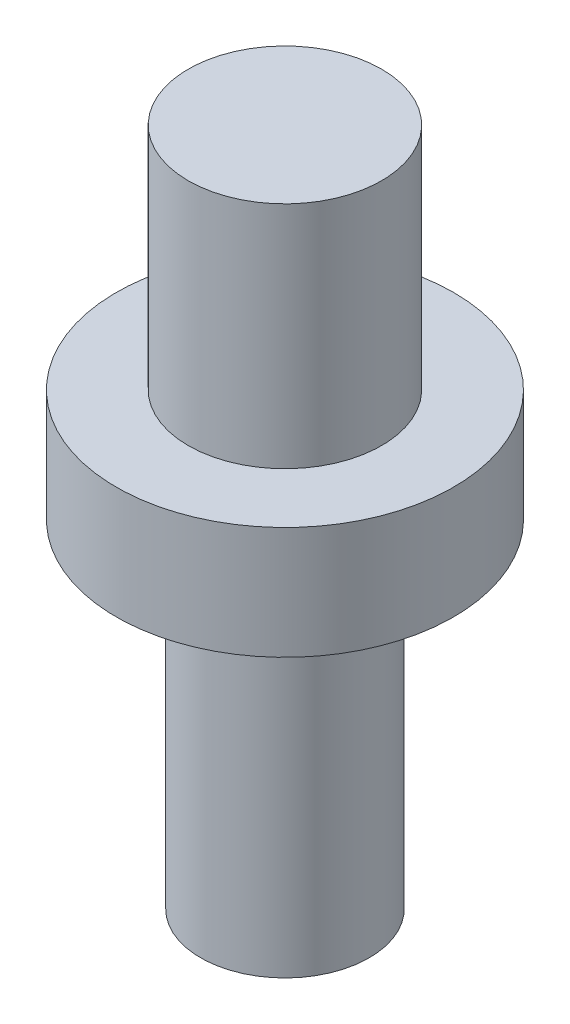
from build123d import *


with BuildPart() as part:
    # Sketch1 → Revolve1 (revolve)
    with BuildSketch(Plane.XY, mode=Mode.PRIVATE) as revolve1_sk:
        Polygon((0, 0), (5.461, 0), (5.461, -12.954), (9.525, -12.954), (9.525, -19.304), (4.7625, -19.304), (4.7625, -38.354), (0, -38.354), align=None)
    revolve(revolve1_sk.sketch.rotate(Axis((0, 0, 0), (0, 1, 0)), 90), axis=Axis((0, 0, 0), (0, 1, 0)))


solid = part.part
